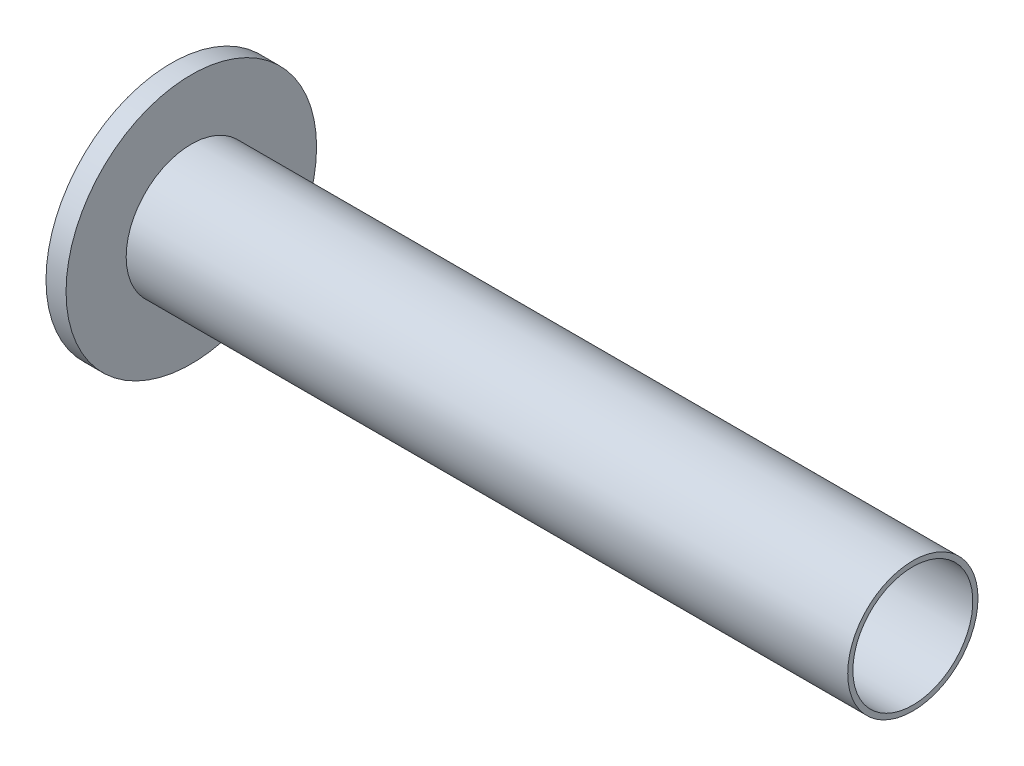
ISO-10303-21;
HEADER;
FILE_DESCRIPTION(('STEP AP214'),'2;1');
FILE_NAME('part.step','',(''),(''),'','','');
FILE_SCHEMA(('AUTOMOTIVE_DESIGN { 1 0 10303 214 1 1 1 1 }'));
ENDSEC;
DATA;
#1=APPLICATION_CONTEXT('core data for automotive mechanical design processes');
#2=APPLICATION_PROTOCOL_DEFINITION('international standard','automotive_design',2000,#1);
#3=PRODUCT_CONTEXT('',#1,'mechanical');
#4=PRODUCT('Part','Part','',(#3));
#5=PRODUCT_RELATED_PRODUCT_CATEGORY('part','',(#4));
#6=PRODUCT_DEFINITION_FORMATION('','',#4);
#7=PRODUCT_DEFINITION_CONTEXT('part definition',#1,'design');
#8=PRODUCT_DEFINITION('design','',#6,#7);
#9=PRODUCT_DEFINITION_SHAPE('','',#8);
#10=(LENGTH_UNIT() NAMED_UNIT(*) SI_UNIT(.MILLI.,.METRE.));
#11=(NAMED_UNIT(*) PLANE_ANGLE_UNIT() SI_UNIT($,.RADIAN.));
#12=(NAMED_UNIT(*) SI_UNIT($,.STERADIAN.) SOLID_ANGLE_UNIT());
#13=UNCERTAINTY_MEASURE_WITH_UNIT(LENGTH_MEASURE(1.E-05),#10,'distance_accuracy_value','');
#14=(GEOMETRIC_REPRESENTATION_CONTEXT(3) GLOBAL_UNCERTAINTY_ASSIGNED_CONTEXT((#13)) GLOBAL_UNIT_ASSIGNED_CONTEXT((#10,
#11,#12)) REPRESENTATION_CONTEXT('',''));
#15=CARTESIAN_POINT('',(0.,0.,0.));
#16=DIRECTION('',(0.,0.,1.));
#17=DIRECTION('',(1.,0.,0.));
#18=AXIS2_PLACEMENT_3D('',#15,#16,#17);
#19=CARTESIAN_POINT('',(228.6,0.,0.));
#20=DIRECTION('',(-1.,0.,0.));
#21=DIRECTION('',(0.,0.,1.));
#22=AXIS2_PLACEMENT_3D('',#19,#20,#21);
#23=CYLINDRICAL_SURFACE('',#22,20.6375);
#24=CARTESIAN_POINT('',(228.6,0.,0.));
#25=DIRECTION('',(1.,0.,0.));
#26=DIRECTION('',(0.,0.,-1.));
#27=AXIS2_PLACEMENT_3D('',#24,#25,#26);
#28=CIRCLE('',#27,20.6375);
#29=CARTESIAN_POINT('',(228.6,0.,-20.6375));
#30=VERTEX_POINT('',#29);
#31=EDGE_CURVE('E10',#30,#30,#28,.T.);
#32=ORIENTED_EDGE('',*,*,#31,.F.);
#33=EDGE_LOOP('',(#32));
#34=FACE_BOUND('',#33,.T.);
#35=CARTESIAN_POINT('',(0.,0.,0.));
#36=DIRECTION('',(-1.,0.,0.));
#37=DIRECTION('',(0.,0.,1.));
#38=AXIS2_PLACEMENT_3D('',#35,#36,#37);
#39=CIRCLE('',#38,20.6375);
#40=CARTESIAN_POINT('',(0.,0.,20.6375));
#41=VERTEX_POINT('',#40);
#42=EDGE_CURVE('E34',#41,#41,#39,.T.);
#43=ORIENTED_EDGE('',*,*,#42,.F.);
#44=EDGE_LOOP('',(#43));
#45=FACE_BOUND('',#44,.T.);
#46=ADVANCED_FACE('F28',(#34,#45),#23,.T.);
#47=CARTESIAN_POINT('',(228.6,0.,0.));
#48=DIRECTION('',(1.,0.,0.));
#49=DIRECTION('',(0.,0.,-1.));
#50=AXIS2_PLACEMENT_3D('',#47,#48,#49);
#51=PLANE('',#50);
#52=CARTESIAN_POINT('',(228.6,0.,0.));
#53=DIRECTION('',(-1.,0.,0.));
#54=DIRECTION('',(0.,0.,1.));
#55=AXIS2_PLACEMENT_3D('',#52,#53,#54);
#56=CIRCLE('',#55,18.9992);
#57=CARTESIAN_POINT('',(228.6,0.,18.9992));
#58=VERTEX_POINT('',#57);
#59=EDGE_CURVE('E47',#58,#58,#56,.T.);
#60=ORIENTED_EDGE('',*,*,#59,.T.);
#61=EDGE_LOOP('',(#60));
#62=FACE_BOUND('',#61,.T.);
#63=ORIENTED_EDGE('',*,*,#31,.T.);
#64=EDGE_LOOP('',(#63));
#65=FACE_BOUND('',#64,.T.);
#66=ADVANCED_FACE('F70',(#62,#65),#51,.T.);
#67=CARTESIAN_POINT('',(0.,0.,0.));
#68=DIRECTION('',(-1.,0.,0.));
#69=DIRECTION('',(0.,0.,1.));
#70=AXIS2_PLACEMENT_3D('',#67,#68,#69);
#71=PLANE('',#70);
#72=CARTESIAN_POINT('',(0.,0.,0.));
#73=DIRECTION('',(-1.,0.,0.));
#74=DIRECTION('',(0.,0.,1.));
#75=AXIS2_PLACEMENT_3D('',#72,#73,#74);
#76=CIRCLE('',#75,39.6875);
#77=CARTESIAN_POINT('',(0.,0.,39.6875));
#78=VERTEX_POINT('',#77);
#79=EDGE_CURVE('E42',#78,#78,#76,.T.);
#80=ORIENTED_EDGE('',*,*,#79,.F.);
#81=EDGE_LOOP('',(#80));
#82=FACE_BOUND('',#81,.T.);
#83=ORIENTED_EDGE('',*,*,#42,.T.);
#84=EDGE_LOOP('',(#83));
#85=FACE_BOUND('',#84,.T.);
#86=ADVANCED_FACE('F65',(#82,#85),#71,.F.);
#87=CARTESIAN_POINT('',(-6.35,0.,0.));
#88=DIRECTION('',(1.,0.,0.));
#89=DIRECTION('',(0.,0.,-1.));
#90=AXIS2_PLACEMENT_3D('',#87,#88,#89);
#91=CYLINDRICAL_SURFACE('',#90,39.6875);
#92=CARTESIAN_POINT('',(-6.35,0.,0.));
#93=DIRECTION('',(-1.,0.,0.));
#94=DIRECTION('',(0.,0.,1.));
#95=AXIS2_PLACEMENT_3D('',#92,#93,#94);
#96=CIRCLE('',#95,39.6875);
#97=CARTESIAN_POINT('',(-6.35,0.,39.6875));
#98=VERTEX_POINT('',#97);
#99=EDGE_CURVE('E38',#98,#98,#96,.T.);
#100=ORIENTED_EDGE('',*,*,#99,.F.);
#101=EDGE_LOOP('',(#100));
#102=FACE_BOUND('',#101,.T.);
#103=ORIENTED_EDGE('',*,*,#79,.T.);
#104=EDGE_LOOP('',(#103));
#105=FACE_BOUND('',#104,.T.);
#106=ADVANCED_FACE('F59',(#102,#105),#91,.T.);
#107=CARTESIAN_POINT('',(-6.35,0.,0.));
#108=DIRECTION('',(-1.,0.,0.));
#109=DIRECTION('',(0.,0.,1.));
#110=AXIS2_PLACEMENT_3D('',#107,#108,#109);
#111=PLANE('',#110);
#112=CARTESIAN_POINT('',(-6.35,0.,0.));
#113=DIRECTION('',(-1.,0.,0.));
#114=DIRECTION('',(0.,0.,1.));
#115=AXIS2_PLACEMENT_3D('',#112,#113,#114);
#116=CIRCLE('',#115,18.9992);
#117=CARTESIAN_POINT('',(-6.35,0.,18.9992));
#118=VERTEX_POINT('',#117);
#119=EDGE_CURVE('E50',#118,#118,#116,.T.);
#120=ORIENTED_EDGE('',*,*,#119,.F.);
#121=EDGE_LOOP('',(#120));
#122=FACE_BOUND('',#121,.T.);
#123=ORIENTED_EDGE('',*,*,#99,.T.);
#124=EDGE_LOOP('',(#123));
#125=FACE_BOUND('',#124,.T.);
#126=ADVANCED_FACE('F56',(#122,#125),#111,.T.);
#127=CARTESIAN_POINT('',(228.6,0.,0.));
#128=DIRECTION('',(-1.,0.,0.));
#129=DIRECTION('',(0.,0.,1.));
#130=AXIS2_PLACEMENT_3D('',#127,#128,#129);
#131=CYLINDRICAL_SURFACE('',#130,18.9992);
#132=ORIENTED_EDGE('',*,*,#59,.F.);
#133=EDGE_LOOP('',(#132));
#134=FACE_BOUND('',#133,.T.);
#135=ORIENTED_EDGE('',*,*,#119,.T.);
#136=EDGE_LOOP('',(#135));
#137=FACE_BOUND('',#136,.T.);
#138=ADVANCED_FACE('F54',(#134,#137),#131,.F.);
#139=CLOSED_SHELL('',(#46,#66,#86,#106,#126,#138));
#140=MANIFOLD_SOLID_BREP('B2',#139);
#141=ADVANCED_BREP_SHAPE_REPRESENTATION('',(#18,#140),#14);
#142=SHAPE_DEFINITION_REPRESENTATION(#9,#141);
ENDSEC;
END-ISO-10303-21;
